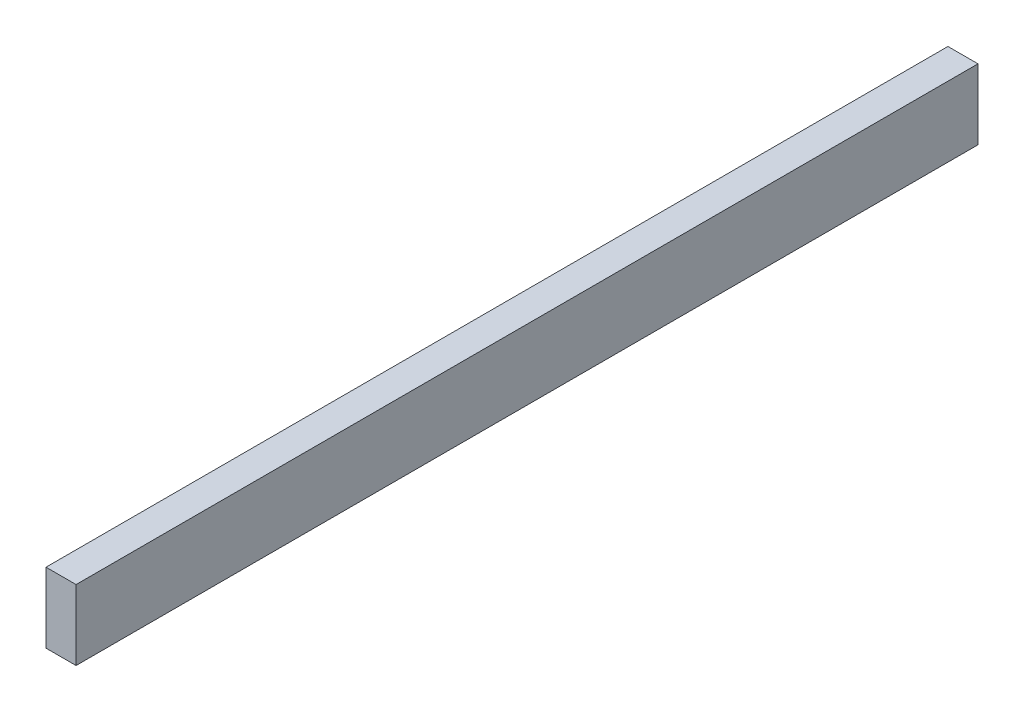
from build123d import *

# Parameters (mm, degrees)
SKETCH1_W           = 38.1
SKETCH1_H           = 88.9
BOSS_EXTRUDE1_DEPTH = 1143


with BuildPart() as part:
    # Sketch1 → Boss-Extrude1 (new body)
    with BuildSketch(Plane.XY):
        Rectangle(SKETCH1_W, SKETCH1_H)
    extrude(amount=-BOSS_EXTRUDE1_DEPTH)


solid = part.part
